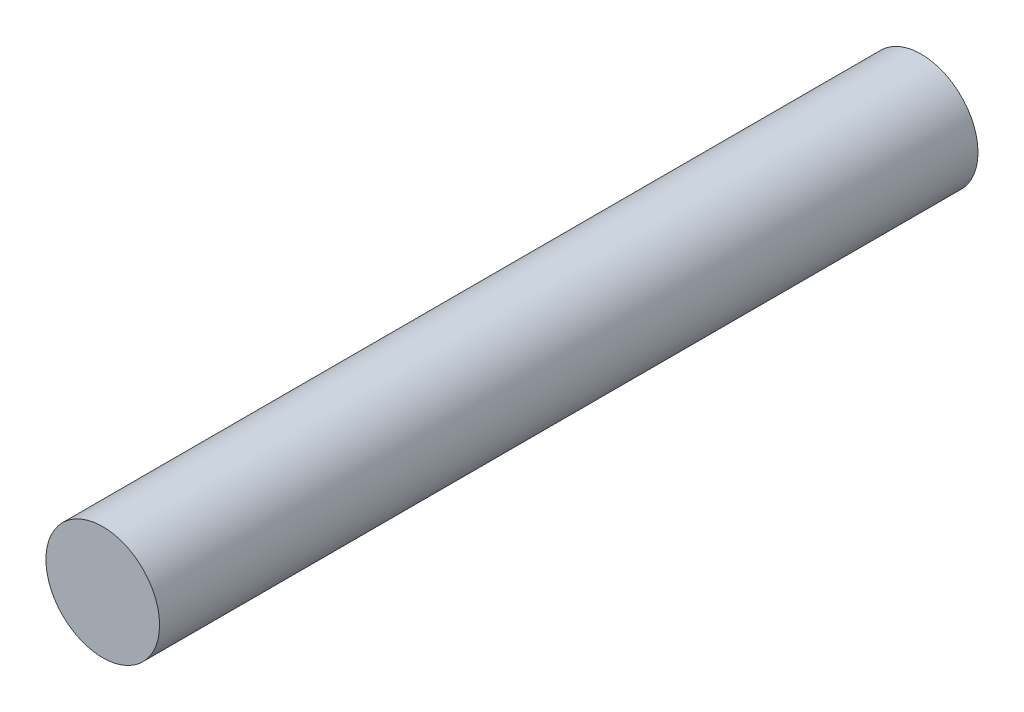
ISO-10303-21;
HEADER;
FILE_DESCRIPTION(('STEP AP214'),'2;1');
FILE_NAME('part.step','',(''),(''),'','','');
FILE_SCHEMA(('AUTOMOTIVE_DESIGN { 1 0 10303 214 1 1 1 1 }'));
ENDSEC;
DATA;
#1=APPLICATION_CONTEXT('core data for automotive mechanical design processes');
#2=APPLICATION_PROTOCOL_DEFINITION('international standard','automotive_design',2000,#1);
#3=PRODUCT_CONTEXT('',#1,'mechanical');
#4=PRODUCT('Part','Part','',(#3));
#5=PRODUCT_RELATED_PRODUCT_CATEGORY('part','',(#4));
#6=PRODUCT_DEFINITION_FORMATION('','',#4);
#7=PRODUCT_DEFINITION_CONTEXT('part definition',#1,'design');
#8=PRODUCT_DEFINITION('design','',#6,#7);
#9=PRODUCT_DEFINITION_SHAPE('','',#8);
#10=(LENGTH_UNIT() NAMED_UNIT(*) SI_UNIT(.MILLI.,.METRE.));
#11=(NAMED_UNIT(*) PLANE_ANGLE_UNIT() SI_UNIT($,.RADIAN.));
#12=(NAMED_UNIT(*) SI_UNIT($,.STERADIAN.) SOLID_ANGLE_UNIT());
#13=UNCERTAINTY_MEASURE_WITH_UNIT(LENGTH_MEASURE(1.E-05),#10,'distance_accuracy_value','');
#14=(GEOMETRIC_REPRESENTATION_CONTEXT(3) GLOBAL_UNCERTAINTY_ASSIGNED_CONTEXT((#13)) GLOBAL_UNIT_ASSIGNED_CONTEXT((#10,
#11,#12)) REPRESENTATION_CONTEXT('',''));
#15=CARTESIAN_POINT('',(0.,0.,0.));
#16=DIRECTION('',(0.,0.,1.));
#17=DIRECTION('',(1.,0.,0.));
#18=AXIS2_PLACEMENT_3D('',#15,#16,#17);
#19=CARTESIAN_POINT('',(0.,0.,11.43));
#20=DIRECTION('',(0.,0.,-1.));
#21=DIRECTION('',(-1.,0.,0.));
#22=AXIS2_PLACEMENT_3D('',#19,#20,#21);
#23=CYLINDRICAL_SURFACE('',#22,1.5875);
#24=CARTESIAN_POINT('',(0.,0.,11.43));
#25=DIRECTION('',(0.,0.,1.));
#26=DIRECTION('',(1.,0.,0.));
#27=AXIS2_PLACEMENT_3D('',#24,#25,#26);
#28=CIRCLE('',#27,1.5875);
#29=CARTESIAN_POINT('',(1.5875,0.,11.43));
#30=VERTEX_POINT('',#29);
#31=EDGE_CURVE('E10',#30,#30,#28,.T.);
#32=ORIENTED_EDGE('',*,*,#31,.F.);
#33=EDGE_LOOP('',(#32));
#34=FACE_BOUND('',#33,.T.);
#35=CARTESIAN_POINT('',(0.,0.,-11.43));
#36=DIRECTION('',(0.,0.,1.));
#37=DIRECTION('',(1.,0.,0.));
#38=AXIS2_PLACEMENT_3D('',#35,#36,#37);
#39=CIRCLE('',#38,1.5875);
#40=CARTESIAN_POINT('',(1.5875,0.,-11.43));
#41=VERTEX_POINT('',#40);
#42=EDGE_CURVE('E34',#41,#41,#39,.T.);
#43=ORIENTED_EDGE('',*,*,#42,.T.);
#44=EDGE_LOOP('',(#43));
#45=FACE_BOUND('',#44,.T.);
#46=ADVANCED_FACE('F31',(#34,#45),#23,.T.);
#47=CARTESIAN_POINT('',(0.,0.,11.43));
#48=DIRECTION('',(0.,0.,1.));
#49=DIRECTION('',(1.,0.,0.));
#50=AXIS2_PLACEMENT_3D('',#47,#48,#49);
#51=PLANE('',#50);
#52=ORIENTED_EDGE('',*,*,#31,.T.);
#53=EDGE_LOOP('',(#52));
#54=FACE_BOUND('',#53,.T.);
#55=ADVANCED_FACE('F46',(#54),#51,.T.);
#56=CARTESIAN_POINT('',(0.,0.,-11.43));
#57=DIRECTION('',(0.,0.,1.));
#58=DIRECTION('',(1.,0.,0.));
#59=AXIS2_PLACEMENT_3D('',#56,#57,#58);
#60=PLANE('',#59);
#61=ORIENTED_EDGE('',*,*,#42,.F.);
#62=EDGE_LOOP('',(#61));
#63=FACE_BOUND('',#62,.T.);
#64=ADVANCED_FACE('F44',(#63),#60,.F.);
#65=CLOSED_SHELL('',(#46,#55,#64));
#66=MANIFOLD_SOLID_BREP('B2',#65);
#67=ADVANCED_BREP_SHAPE_REPRESENTATION('',(#18,#66),#14);
#68=SHAPE_DEFINITION_REPRESENTATION(#9,#67);
ENDSEC;
END-ISO-10303-21;
